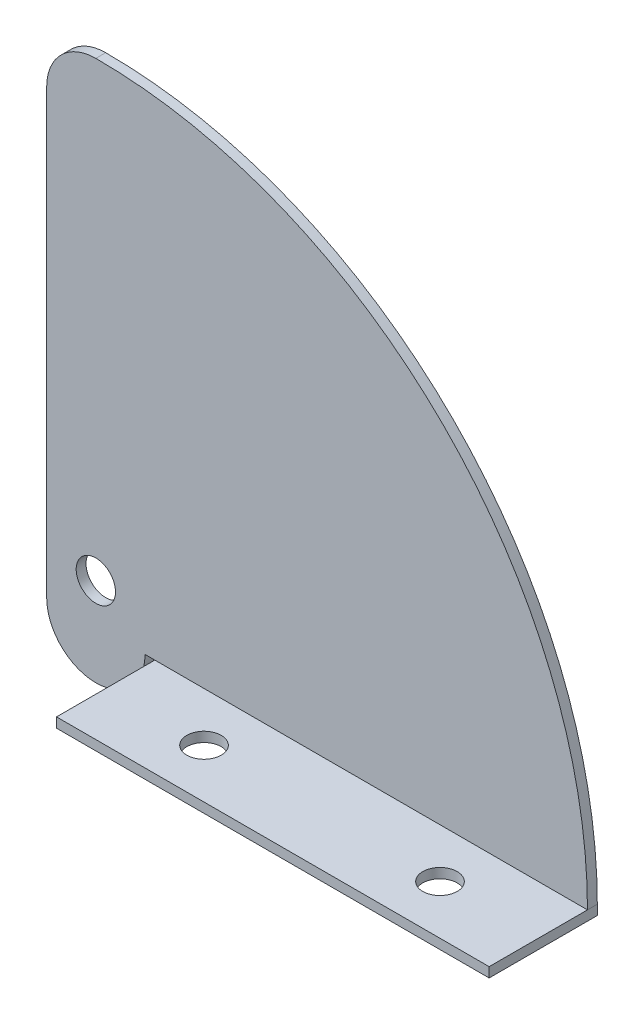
from build123d import *

# Parameters (mm, degrees)
SKETCH1_R      = 2
EXTRUDE1_DEPTH = 1
SKETCH5_W      = 44
SKETCH5_H      = 11
SKETCH5_R      = 1.75
EXTRUDE2_DEPTH = 1


with BuildPart() as part:
    # Sketch1 → Extrude1 (new body)
    with BuildSketch(Plane.XY):
        with BuildLine():
            Line((5, 0), (50, 0))
            ThreePointArc((50, 0), (35.355339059, 35.355339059), (0, 50))
            ThreePointArc((0, 50), (-3.535533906, 48.535533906), (-5, 45))
            Line((-5, 45), (-5, 0))
            ThreePointArc((-5, 0), (0, -5), (5, 0))
        make_face()
        with Locations((0, 4)):
            Circle(SKETCH1_R, mode=Mode.SUBTRACT)
    extrude(amount=EXTRUDE1_DEPTH)

    # Sketch5 → Extrude2 (add)
    with BuildSketch(Plane.XZ):
        with Locations((28, 5.5)):
            Rectangle(SKETCH5_W, SKETCH5_H)
        with Locations(Location((40, 6, 0), (0, 0, 270))):
            Circle(SKETCH5_R, mode=Mode.SUBTRACT)
        with Locations(Location((16, 6, 0), (0, 0, 270))):
            Circle(SKETCH5_R, mode=Mode.SUBTRACT)
    extrude(amount=EXTRUDE2_DEPTH)


solid = part.part
